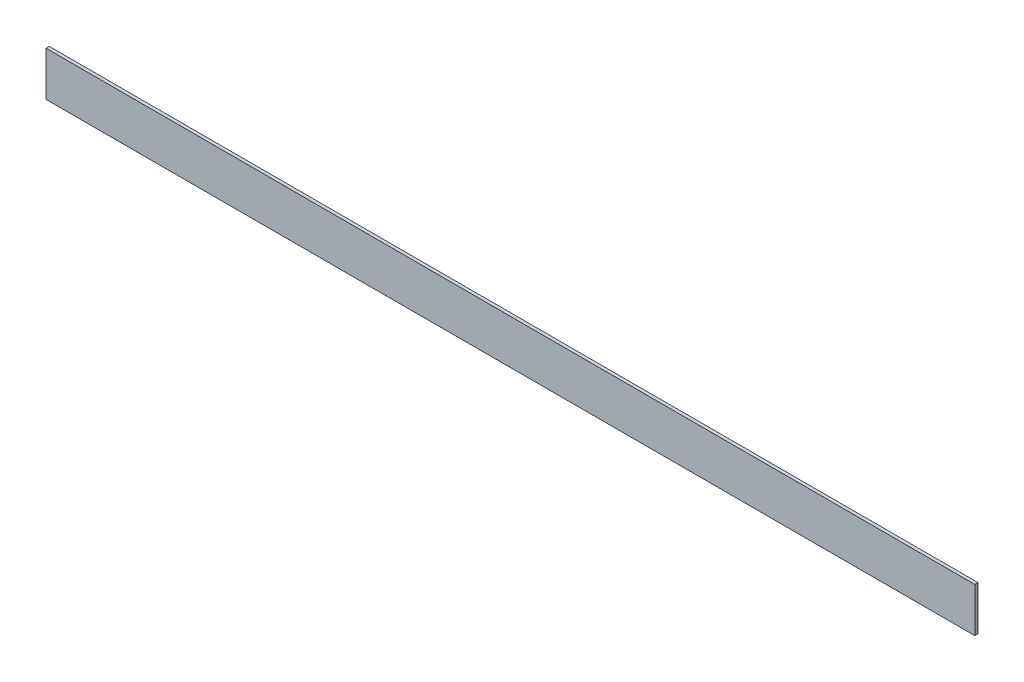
ISO-10303-21;
HEADER;
FILE_DESCRIPTION(('STEP AP214'),'2;1');
FILE_NAME('part.step','',(''),(''),'','','');
FILE_SCHEMA(('AUTOMOTIVE_DESIGN { 1 0 10303 214 1 1 1 1 }'));
ENDSEC;
DATA;
#1=APPLICATION_CONTEXT('core data for automotive mechanical design processes');
#2=APPLICATION_PROTOCOL_DEFINITION('international standard','automotive_design',2000,#1);
#3=PRODUCT_CONTEXT('',#1,'mechanical');
#4=PRODUCT('Part','Part','',(#3));
#5=PRODUCT_RELATED_PRODUCT_CATEGORY('part','',(#4));
#6=PRODUCT_DEFINITION_FORMATION('','',#4);
#7=PRODUCT_DEFINITION_CONTEXT('part definition',#1,'design');
#8=PRODUCT_DEFINITION('design','',#6,#7);
#9=PRODUCT_DEFINITION_SHAPE('','',#8);
#10=(LENGTH_UNIT() NAMED_UNIT(*) SI_UNIT(.MILLI.,.METRE.));
#11=(NAMED_UNIT(*) PLANE_ANGLE_UNIT() SI_UNIT($,.RADIAN.));
#12=(NAMED_UNIT(*) SI_UNIT($,.STERADIAN.) SOLID_ANGLE_UNIT());
#13=UNCERTAINTY_MEASURE_WITH_UNIT(LENGTH_MEASURE(1.E-05),#10,'distance_accuracy_value','');
#14=(GEOMETRIC_REPRESENTATION_CONTEXT(3) GLOBAL_UNCERTAINTY_ASSIGNED_CONTEXT((#13)) GLOBAL_UNIT_ASSIGNED_CONTEXT((#10,
#11,#12)) REPRESENTATION_CONTEXT('',''));
#15=CARTESIAN_POINT('',(0.,0.,0.));
#16=DIRECTION('',(0.,0.,1.));
#17=DIRECTION('',(1.,0.,0.));
#18=AXIS2_PLACEMENT_3D('',#15,#16,#17);
#19=CARTESIAN_POINT('',(-86.5216305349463,52.6453801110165,-2.286));
#20=DIRECTION('',(-1.,0.,0.));
#21=DIRECTION('',(0.,-1.,0.));
#22=AXIS2_PLACEMENT_3D('',#19,#20,#21);
#23=PLANE('',#22);
#24=DIRECTION('',(0.,-1.,0.));
#25=VECTOR('',#24,1.);
#26=CARTESIAN_POINT('',(-86.5216305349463,52.6453801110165,0.));
#27=LINE('',#26,#25);
#28=CARTESIAN_POINT('',(-86.5216305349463,52.6453801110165,0.));
#29=VERTEX_POINT('',#28);
#30=CARTESIAN_POINT('',(-86.5216305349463,20.8953801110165,0.));
#31=VERTEX_POINT('',#30);
#32=EDGE_CURVE('E101',#29,#31,#27,.T.);
#33=ORIENTED_EDGE('',*,*,#32,.F.);
#34=DIRECTION('',(0.,0.,1.));
#35=VECTOR('',#34,1.);
#36=CARTESIAN_POINT('',(-86.5216305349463,52.6453801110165,-2.286));
#37=LINE('',#36,#35);
#38=CARTESIAN_POINT('',(-86.5216305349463,52.6453801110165,-2.286));
#39=VERTEX_POINT('',#38);
#40=EDGE_CURVE('E11',#39,#29,#37,.T.);
#41=ORIENTED_EDGE('',*,*,#40,.F.);
#42=DIRECTION('',(0.,-1.,0.));
#43=VECTOR('',#42,1.);
#44=CARTESIAN_POINT('',(-86.5216305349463,52.6453801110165,-2.286));
#45=LINE('',#44,#43);
#46=CARTESIAN_POINT('',(-86.5216305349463,20.8953801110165,-2.286));
#47=VERTEX_POINT('',#46);
#48=EDGE_CURVE('E95',#39,#47,#45,.T.);
#49=ORIENTED_EDGE('',*,*,#48,.T.);
#50=DIRECTION('',(0.,0.,1.));
#51=VECTOR('',#50,1.);
#52=CARTESIAN_POINT('',(-86.5216305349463,20.8953801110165,-2.286));
#53=LINE('',#52,#51);
#54=EDGE_CURVE('E40',#47,#31,#53,.T.);
#55=ORIENTED_EDGE('',*,*,#54,.T.);
#56=EDGE_LOOP('',(#33,#41,#49,#55));
#57=FACE_BOUND('',#56,.T.);
#58=ADVANCED_FACE('F37',(#57),#23,.T.);
#59=CARTESIAN_POINT('',(-86.5216305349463,52.6453801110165,-2.286));
#60=DIRECTION('',(0.,1.,0.));
#61=DIRECTION('',(0.,0.,1.));
#62=AXIS2_PLACEMENT_3D('',#59,#60,#61);
#63=PLANE('',#62);
#64=DIRECTION('',(-1.,0.,0.));
#65=VECTOR('',#64,1.);
#66=CARTESIAN_POINT('',(-86.5216305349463,52.6453801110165,0.));
#67=LINE('',#66,#65);
#68=CARTESIAN_POINT('',(578.196369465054,52.6453801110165,0.));
#69=VERTEX_POINT('',#68);
#70=EDGE_CURVE('E97',#69,#29,#67,.T.);
#71=ORIENTED_EDGE('',*,*,#70,.F.);
#72=DIRECTION('',(0.,0.,1.));
#73=VECTOR('',#72,1.);
#74=CARTESIAN_POINT('',(578.196369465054,52.6453801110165,-2.286));
#75=LINE('',#74,#73);
#76=CARTESIAN_POINT('',(578.196369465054,52.6453801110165,-2.286));
#77=VERTEX_POINT('',#76);
#78=EDGE_CURVE('E46',#77,#69,#75,.T.);
#79=ORIENTED_EDGE('',*,*,#78,.F.);
#80=DIRECTION('',(-1.,0.,0.));
#81=VECTOR('',#80,1.);
#82=CARTESIAN_POINT('',(-86.5216305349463,52.6453801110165,-2.286));
#83=LINE('',#82,#81);
#84=EDGE_CURVE('E92',#77,#39,#83,.T.);
#85=ORIENTED_EDGE('',*,*,#84,.T.);
#86=ORIENTED_EDGE('',*,*,#40,.T.);
#87=EDGE_LOOP('',(#71,#79,#85,#86));
#88=FACE_BOUND('',#87,.T.);
#89=ADVANCED_FACE('F111',(#88),#63,.T.);
#90=CARTESIAN_POINT('',(578.196369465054,52.6453801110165,-2.286));
#91=DIRECTION('',(1.,0.,0.));
#92=DIRECTION('',(0.,0.,-1.));
#93=AXIS2_PLACEMENT_3D('',#90,#91,#92);
#94=PLANE('',#93);
#95=DIRECTION('',(0.,1.,0.));
#96=VECTOR('',#95,1.);
#97=CARTESIAN_POINT('',(578.196369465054,52.6453801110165,0.));
#98=LINE('',#97,#96);
#99=CARTESIAN_POINT('',(578.196369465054,20.8953801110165,0.));
#100=VERTEX_POINT('',#99);
#101=EDGE_CURVE('E87',#100,#69,#98,.T.);
#102=ORIENTED_EDGE('',*,*,#101,.F.);
#103=DIRECTION('',(0.,0.,1.));
#104=VECTOR('',#103,1.);
#105=CARTESIAN_POINT('',(578.196369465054,20.8953801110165,-2.286));
#106=LINE('',#105,#104);
#107=CARTESIAN_POINT('',(578.196369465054,20.8953801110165,-2.286));
#108=VERTEX_POINT('',#107);
#109=EDGE_CURVE('E82',#108,#100,#106,.T.);
#110=ORIENTED_EDGE('',*,*,#109,.F.);
#111=DIRECTION('',(0.,1.,0.));
#112=VECTOR('',#111,1.);
#113=CARTESIAN_POINT('',(578.196369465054,52.6453801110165,-2.286));
#114=LINE('',#113,#112);
#115=EDGE_CURVE('E85',#108,#77,#114,.T.);
#116=ORIENTED_EDGE('',*,*,#115,.T.);
#117=ORIENTED_EDGE('',*,*,#78,.T.);
#118=EDGE_LOOP('',(#102,#110,#116,#117));
#119=FACE_BOUND('',#118,.T.);
#120=ADVANCED_FACE('F84',(#119),#94,.T.);
#121=CARTESIAN_POINT('',(-86.5216305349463,20.8953801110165,-2.286));
#122=DIRECTION('',(0.,-1.,0.));
#123=DIRECTION('',(0.,0.,-1.));
#124=AXIS2_PLACEMENT_3D('',#121,#122,#123);
#125=PLANE('',#124);
#126=DIRECTION('',(1.,0.,0.));
#127=VECTOR('',#126,1.);
#128=CARTESIAN_POINT('',(-86.5216305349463,20.8953801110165,0.));
#129=LINE('',#128,#127);
#130=EDGE_CURVE('E104',#31,#100,#129,.T.);
#131=ORIENTED_EDGE('',*,*,#130,.F.);
#132=ORIENTED_EDGE('',*,*,#54,.F.);
#133=DIRECTION('',(1.,0.,0.));
#134=VECTOR('',#133,1.);
#135=CARTESIAN_POINT('',(-86.5216305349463,20.8953801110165,-2.286));
#136=LINE('',#135,#134);
#137=EDGE_CURVE('E91',#47,#108,#136,.T.);
#138=ORIENTED_EDGE('',*,*,#137,.T.);
#139=ORIENTED_EDGE('',*,*,#109,.T.);
#140=EDGE_LOOP('',(#131,#132,#138,#139));
#141=FACE_BOUND('',#140,.T.);
#142=ADVANCED_FACE('F94',(#141),#125,.T.);
#143=CARTESIAN_POINT('',(0.,0.,-2.286));
#144=DIRECTION('',(0.,0.,1.));
#145=DIRECTION('',(1.,0.,0.));
#146=AXIS2_PLACEMENT_3D('',#143,#144,#145);
#147=PLANE('',#146);
#148=ORIENTED_EDGE('',*,*,#48,.F.);
#149=ORIENTED_EDGE('',*,*,#84,.F.);
#150=ORIENTED_EDGE('',*,*,#115,.F.);
#151=ORIENTED_EDGE('',*,*,#137,.F.);
#152=EDGE_LOOP('',(#148,#149,#150,#151));
#153=FACE_BOUND('',#152,.T.);
#154=ADVANCED_FACE('F90',(#153),#147,.F.);
#155=CARTESIAN_POINT('',(0.,0.,0.));
#156=DIRECTION('',(0.,0.,1.));
#157=DIRECTION('',(1.,0.,0.));
#158=AXIS2_PLACEMENT_3D('',#155,#156,#157);
#159=PLANE('',#158);
#160=ORIENTED_EDGE('',*,*,#32,.T.);
#161=ORIENTED_EDGE('',*,*,#130,.T.);
#162=ORIENTED_EDGE('',*,*,#101,.T.);
#163=ORIENTED_EDGE('',*,*,#70,.T.);
#164=EDGE_LOOP('',(#160,#161,#162,#163));
#165=FACE_BOUND('',#164,.T.);
#166=ADVANCED_FACE('F110',(#165),#159,.T.);
#167=CLOSED_SHELL('',(#58,#89,#120,#142,#154,#166));
#168=MANIFOLD_SOLID_BREP('B2',#167);
#169=ADVANCED_BREP_SHAPE_REPRESENTATION('',(#18,#168),#14);
#170=SHAPE_DEFINITION_REPRESENTATION(#9,#169);
ENDSEC;
END-ISO-10303-21;
